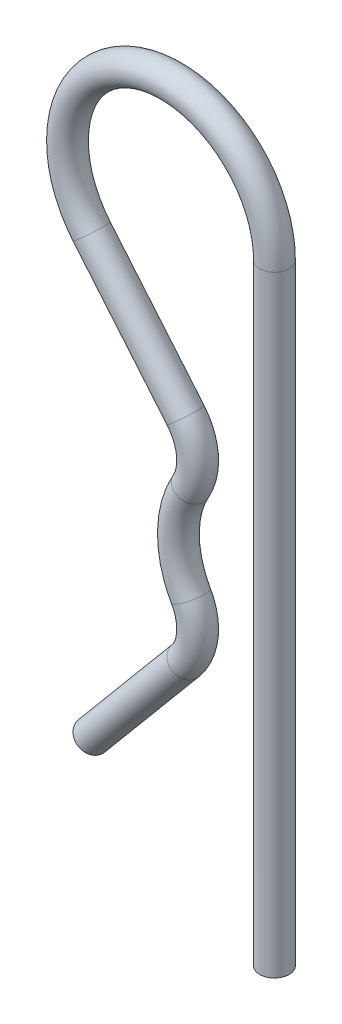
ISO-10303-21;
HEADER;
FILE_DESCRIPTION(('STEP AP214'),'2;1');
FILE_NAME('part.step','',(''),(''),'','','');
FILE_SCHEMA(('AUTOMOTIVE_DESIGN { 1 0 10303 214 1 1 1 1 }'));
ENDSEC;
DATA;
#1=APPLICATION_CONTEXT('core data for automotive mechanical design processes');
#2=APPLICATION_PROTOCOL_DEFINITION('international standard','automotive_design',2000,#1);
#3=PRODUCT_CONTEXT('',#1,'mechanical');
#4=PRODUCT('Part','Part','',(#3));
#5=PRODUCT_RELATED_PRODUCT_CATEGORY('part','',(#4));
#6=PRODUCT_DEFINITION_FORMATION('','',#4);
#7=PRODUCT_DEFINITION_CONTEXT('part definition',#1,'design');
#8=PRODUCT_DEFINITION('design','',#6,#7);
#9=PRODUCT_DEFINITION_SHAPE('','',#8);
#10=(LENGTH_UNIT() NAMED_UNIT(*) SI_UNIT(.MILLI.,.METRE.));
#11=(NAMED_UNIT(*) PLANE_ANGLE_UNIT() SI_UNIT($,.RADIAN.));
#12=(NAMED_UNIT(*) SI_UNIT($,.STERADIAN.) SOLID_ANGLE_UNIT());
#13=UNCERTAINTY_MEASURE_WITH_UNIT(LENGTH_MEASURE(1.E-05),#10,'distance_accuracy_value','');
#14=(GEOMETRIC_REPRESENTATION_CONTEXT(3) GLOBAL_UNCERTAINTY_ASSIGNED_CONTEXT((#13)) GLOBAL_UNIT_ASSIGNED_CONTEXT((#10,
#11,#12)) REPRESENTATION_CONTEXT('',''));
#15=CARTESIAN_POINT('',(0.,0.,0.));
#16=DIRECTION('',(0.,0.,1.));
#17=DIRECTION('',(1.,0.,0.));
#18=AXIS2_PLACEMENT_3D('',#15,#16,#17);
#19=CARTESIAN_POINT('',(-4.50960362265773,-5.38728597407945,0.));
#20=DIRECTION('',(-0.641879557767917,-0.766805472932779,0.));
#21=DIRECTION('',(0.766805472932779,-0.641879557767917,0.));
#22=AXIS2_PLACEMENT_3D('',#19,#20,#21);
#23=CYLINDRICAL_SURFACE('',#22,0.75);
#24=CARTESIAN_POINT('',(-4.50960362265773,-5.38728597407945,0.));
#25=DIRECTION('',(-0.641879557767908,-0.766805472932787,0.));
#26=DIRECTION('',(0.,0.,1.));
#27=AXIS2_PLACEMENT_3D('',#24,#25,#26);
#28=CIRCLE('',#27,0.75);
#29=CARTESIAN_POINT('',(-3.93449951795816,-5.86869564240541,0.));
#30=VERTEX_POINT('',#29);
#31=EDGE_CURVE('E30',#30,#30,#28,.T.);
#32=ORIENTED_EDGE('',*,*,#31,.T.);
#33=EDGE_LOOP('',(#32));
#34=FACE_BOUND('',#33,.T.);
#35=CARTESIAN_POINT('',(-9.27572873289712,-11.0810189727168,0.));
#36=DIRECTION('',(-0.641879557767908,-0.766805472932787,0.));
#37=DIRECTION('',(0.,0.,1.));
#38=AXIS2_PLACEMENT_3D('',#35,#36,#37);
#39=CIRCLE('',#38,0.75);
#40=CARTESIAN_POINT('',(-9.27572873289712,-11.0810189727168,0.75));
#41=VERTEX_POINT('',#40);
#42=EDGE_CURVE('E10',#41,#41,#39,.T.);
#43=ORIENTED_EDGE('',*,*,#42,.F.);
#44=EDGE_LOOP('',(#43));
#45=FACE_BOUND('',#44,.T.);
#46=ADVANCED_FACE('F24',(#34,#45),#23,.T.);
#47=CARTESIAN_POINT('',(-6.52246798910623,-3.70235213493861,0.));
#48=DIRECTION('',(0.,0.,-1.));
#49=DIRECTION('',(-1.,0.,0.));
#50=AXIS2_PLACEMENT_3D('',#47,#48,#49);
#51=TOROIDAL_SURFACE('',#50,2.62500000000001,0.75);
#52=CARTESIAN_POINT('',(-4.23960419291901,-2.40652888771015,0.));
#53=DIRECTION('',(0.49364695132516,-0.869662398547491,0.));
#54=DIRECTION('',(0.,0.,1.));
#55=AXIS2_PLACEMENT_3D('',#52,#53,#54);
#56=CIRCLE('',#55,0.75);
#57=CARTESIAN_POINT('',(-3.58735739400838,-2.03629367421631,0.));
#58=VERTEX_POINT('',#57);
#59=EDGE_CURVE('E34',#58,#58,#56,.T.);
#60=CARTESIAN_POINT('',(-6.52246798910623,-3.70235213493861,0.));
#61=DIRECTION('',(0.,0.,-1.));
#62=DIRECTION('',(-1.,0.,0.));
#63=AXIS2_PLACEMENT_3D('',#60,#61,#62);
#64=CIRCLE('',#63,3.37500000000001);
#65=EDGE_CURVE('',#58,#30,#64,.T.);
#66=ORIENTED_EDGE('',*,*,#59,.T.);
#67=ORIENTED_EDGE('',*,*,#31,.F.);
#68=ORIENTED_EDGE('',*,*,#65,.T.);
#69=ORIENTED_EDGE('',*,*,#65,.F.);
#70=EDGE_LOOP('',(#66,#68,#67,#69));
#71=FACE_BOUND('',#70,.T.);
#72=ADVANCED_FACE('F67',(#71),#51,.T.);
#73=CARTESIAN_POINT('',(0.,0.,0.));
#74=DIRECTION('',(0.,0.,1.));
#75=DIRECTION('',(1.,0.,0.));
#76=AXIS2_PLACEMENT_3D('',#73,#74,#75);
#77=TOROIDAL_SURFACE('',#76,4.87499999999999,0.75);
#78=CARTESIAN_POINT('',(-4.23960419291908,2.40652888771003,0.));
#79=DIRECTION('',(-0.493646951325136,-0.869662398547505,0.));
#80=DIRECTION('',(0.,0.,1.));
#81=AXIS2_PLACEMENT_3D('',#78,#79,#80);
#82=CIRCLE('',#81,0.75);
#83=CARTESIAN_POINT('',(-3.58735739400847,2.03629367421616,0.));
#84=VERTEX_POINT('',#83);
#85=EDGE_CURVE('E38',#84,#84,#82,.T.);
#86=ORIENTED_EDGE('',*,*,#85,.T.);
#87=EDGE_LOOP('',(#86));
#88=FACE_BOUND('',#87,.T.);
#89=ORIENTED_EDGE('',*,*,#59,.F.);
#90=EDGE_LOOP('',(#89));
#91=FACE_BOUND('',#90,.T.);
#92=ADVANCED_FACE('F71',(#88,#91),#77,.T.);
#93=CARTESIAN_POINT('',(-6.52246798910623,3.70235213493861,0.));
#94=DIRECTION('',(0.,0.,-1.));
#95=DIRECTION('',(-1.,0.,0.));
#96=AXIS2_PLACEMENT_3D('',#93,#94,#95);
#97=TOROIDAL_SURFACE('',#96,2.62500000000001,0.75);
#98=CARTESIAN_POINT('',(-4.50960362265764,5.38728597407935,0.));
#99=DIRECTION('',(0.641879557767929,-0.766805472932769,0.));
#100=DIRECTION('',(0.,0.,1.));
#101=AXIS2_PLACEMENT_3D('',#98,#99,#100);
#102=CIRCLE('',#101,0.75);
#103=CARTESIAN_POINT('',(-3.93449951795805,5.86869564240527,0.));
#104=VERTEX_POINT('',#103);
#105=EDGE_CURVE('E43',#104,#104,#102,.T.);
#106=CARTESIAN_POINT('',(-6.52246798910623,3.70235213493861,0.));
#107=DIRECTION('',(0.,0.,-1.));
#108=DIRECTION('',(-1.,0.,0.));
#109=AXIS2_PLACEMENT_3D('',#106,#107,#108);
#110=CIRCLE('',#109,3.37500000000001);
#111=EDGE_CURVE('',#104,#84,#110,.T.);
#112=ORIENTED_EDGE('',*,*,#105,.T.);
#113=ORIENTED_EDGE('',*,*,#85,.F.);
#114=ORIENTED_EDGE('',*,*,#111,.T.);
#115=ORIENTED_EDGE('',*,*,#111,.F.);
#116=EDGE_LOOP('',(#112,#114,#113,#115));
#117=FACE_BOUND('',#116,.T.);
#118=ADVANCED_FACE('F77',(#117),#97,.T.);
#119=CARTESIAN_POINT('',(-9.27572873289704,11.0810189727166,0.));
#120=DIRECTION('',(0.641879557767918,-0.766805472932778,0.));
#121=DIRECTION('',(0.766805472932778,0.641879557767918,0.));
#122=AXIS2_PLACEMENT_3D('',#119,#120,#121);
#123=CYLINDRICAL_SURFACE('',#122,0.75);
#124=CARTESIAN_POINT('',(-9.27572873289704,11.0810189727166,0.));
#125=DIRECTION('',(0.641879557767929,-0.766805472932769,0.));
#126=DIRECTION('',(0.,0.,1.));
#127=AXIS2_PLACEMENT_3D('',#124,#125,#126);
#128=CIRCLE('',#127,0.75);
#129=CARTESIAN_POINT('',(-9.85083283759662,10.5996093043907,0.));
#130=VERTEX_POINT('',#129);
#131=EDGE_CURVE('E46',#130,#130,#128,.T.);
#132=ORIENTED_EDGE('',*,*,#131,.T.);
#133=EDGE_LOOP('',(#132));
#134=FACE_BOUND('',#133,.T.);
#135=ORIENTED_EDGE('',*,*,#105,.F.);
#136=EDGE_LOOP('',(#135));
#137=FACE_BOUND('',#136,.T.);
#138=ADVANCED_FACE('F84',(#134,#137),#123,.T.);
#139=CARTESIAN_POINT('',(-5.25,14.4508866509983,0.));
#140=DIRECTION('',(0.,0.,1.));
#141=DIRECTION('',(1.,0.,0.));
#142=AXIS2_PLACEMENT_3D('',#139,#140,#141);
#143=TOROIDAL_SURFACE('',#142,5.25,0.75);
#144=CARTESIAN_POINT('',(0.,14.4508866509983,0.));
#145=DIRECTION('',(0.,1.,0.));
#146=DIRECTION('',(0.,0.,1.));
#147=AXIS2_PLACEMENT_3D('',#144,#145,#146);
#148=CIRCLE('',#147,0.75);
#149=CARTESIAN_POINT('',(0.749999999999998,14.4508866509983,0.));
#150=VERTEX_POINT('',#149);
#151=EDGE_CURVE('E49',#150,#150,#148,.T.);
#152=CARTESIAN_POINT('',(-5.25,14.4508866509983,0.));
#153=DIRECTION('',(0.,0.,1.));
#154=DIRECTION('',(1.,0.,0.));
#155=AXIS2_PLACEMENT_3D('',#152,#153,#154);
#156=CIRCLE('',#155,6.);
#157=EDGE_CURVE('',#150,#130,#156,.T.);
#158=ORIENTED_EDGE('',*,*,#151,.T.);
#159=ORIENTED_EDGE('',*,*,#131,.F.);
#160=ORIENTED_EDGE('',*,*,#157,.T.);
#161=ORIENTED_EDGE('',*,*,#157,.F.);
#162=EDGE_LOOP('',(#158,#160,#159,#161));
#163=FACE_BOUND('',#162,.T.);
#164=ADVANCED_FACE('F88',(#163),#143,.T.);
#165=CARTESIAN_POINT('',(0.,14.4508866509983,0.));
#166=DIRECTION('',(0.,-1.,0.));
#167=DIRECTION('',(1.,0.,0.));
#168=AXIS2_PLACEMENT_3D('',#165,#166,#167);
#169=CYLINDRICAL_SURFACE('',#168,0.75);
#170=ORIENTED_EDGE('',*,*,#151,.F.);
#171=EDGE_LOOP('',(#170));
#172=FACE_BOUND('',#171,.T.);
#173=CARTESIAN_POINT('',(0.,-16.5491133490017,0.));
#174=DIRECTION('',(0.,1.,0.));
#175=DIRECTION('',(0.,0.,1.));
#176=AXIS2_PLACEMENT_3D('',#173,#174,#175);
#177=CIRCLE('',#176,0.75);
#178=CARTESIAN_POINT('',(0.,-16.5491133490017,0.75));
#179=VERTEX_POINT('',#178);
#180=EDGE_CURVE('E52',#179,#179,#177,.T.);
#181=ORIENTED_EDGE('',*,*,#180,.T.);
#182=EDGE_LOOP('',(#181));
#183=FACE_BOUND('',#182,.T.);
#184=ADVANCED_FACE('F56',(#172,#183),#169,.T.);
#185=CARTESIAN_POINT('',(-9.27572873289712,-11.0810189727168,0.));
#186=DIRECTION('',(-0.641879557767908,-0.766805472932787,0.));
#187=DIRECTION('',(0.,0.,1.));
#188=AXIS2_PLACEMENT_3D('',#185,#186,#187);
#189=PLANE('',#188);
#190=ORIENTED_EDGE('',*,*,#42,.T.);
#191=EDGE_LOOP('',(#190));
#192=FACE_BOUND('',#191,.T.);
#193=ADVANCED_FACE('F60',(#192),#189,.T.);
#194=CARTESIAN_POINT('',(0.,-16.5491133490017,0.));
#195=DIRECTION('',(0.,1.,0.));
#196=DIRECTION('',(0.,0.,1.));
#197=AXIS2_PLACEMENT_3D('',#194,#195,#196);
#198=PLANE('',#197);
#199=ORIENTED_EDGE('',*,*,#180,.F.);
#200=EDGE_LOOP('',(#199));
#201=FACE_BOUND('',#200,.T.);
#202=ADVANCED_FACE('F58',(#201),#198,.F.);
#203=CLOSED_SHELL('',(#46,#72,#92,#118,#138,#164,#184,#193,#202));
#204=MANIFOLD_SOLID_BREP('B2',#203);
#205=ADVANCED_BREP_SHAPE_REPRESENTATION('',(#18,#204),#14);
#206=SHAPE_DEFINITION_REPRESENTATION(#9,#205);
ENDSEC;
END-ISO-10303-21;
